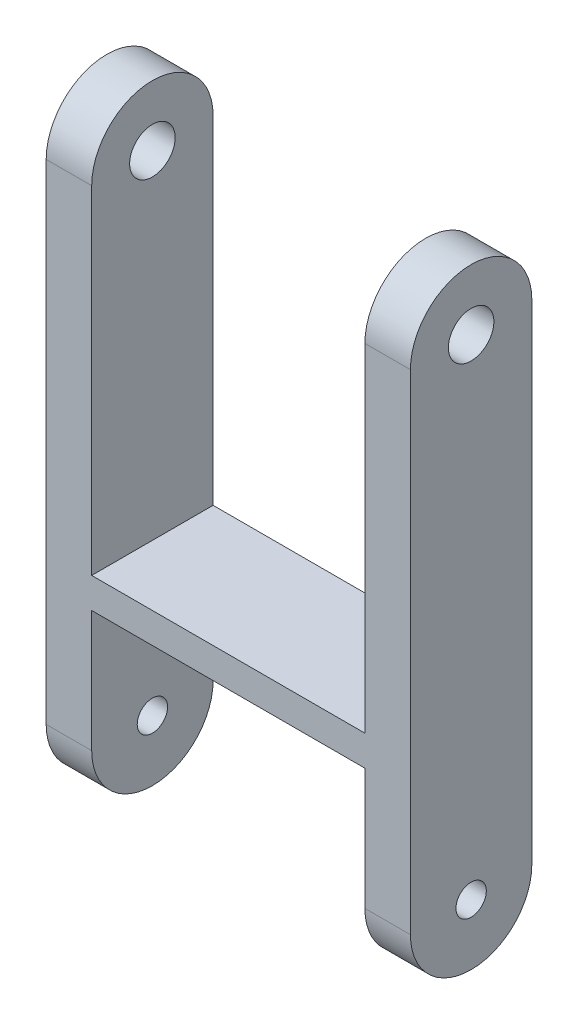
ISO-10303-21;
HEADER;
FILE_DESCRIPTION(('STEP AP214'),'2;1');
FILE_NAME('part.step','',(''),(''),'','','');
FILE_SCHEMA(('AUTOMOTIVE_DESIGN { 1 0 10303 214 1 1 1 1 }'));
ENDSEC;
DATA;
#1=APPLICATION_CONTEXT('core data for automotive mechanical design processes');
#2=APPLICATION_PROTOCOL_DEFINITION('international standard','automotive_design',2000,#1);
#3=PRODUCT_CONTEXT('',#1,'mechanical');
#4=PRODUCT('Part','Part','',(#3));
#5=PRODUCT_RELATED_PRODUCT_CATEGORY('part','',(#4));
#6=PRODUCT_DEFINITION_FORMATION('','',#4);
#7=PRODUCT_DEFINITION_CONTEXT('part definition',#1,'design');
#8=PRODUCT_DEFINITION('design','',#6,#7);
#9=PRODUCT_DEFINITION_SHAPE('','',#8);
#10=(LENGTH_UNIT() NAMED_UNIT(*) SI_UNIT(.MILLI.,.METRE.));
#11=(NAMED_UNIT(*) PLANE_ANGLE_UNIT() SI_UNIT($,.RADIAN.));
#12=(NAMED_UNIT(*) SI_UNIT($,.STERADIAN.) SOLID_ANGLE_UNIT());
#13=UNCERTAINTY_MEASURE_WITH_UNIT(LENGTH_MEASURE(1.E-05),#10,'distance_accuracy_value','');
#14=(GEOMETRIC_REPRESENTATION_CONTEXT(3) GLOBAL_UNCERTAINTY_ASSIGNED_CONTEXT((#13)) GLOBAL_UNIT_ASSIGNED_CONTEXT((#10,
#11,#12)) REPRESENTATION_CONTEXT('',''));
#15=CARTESIAN_POINT('',(0.,0.,0.));
#16=DIRECTION('',(0.,0.,1.));
#17=DIRECTION('',(1.,0.,0.));
#18=AXIS2_PLACEMENT_3D('',#15,#16,#17);
#19=CARTESIAN_POINT('',(76.2,-102.358208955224,0.));
#20=DIRECTION('',(-1.,0.,0.));
#21=DIRECTION('',(0.,0.,1.));
#22=AXIS2_PLACEMENT_3D('',#19,#20,#21);
#23=CYLINDRICAL_SURFACE('',#22,25.4);
#24=DIRECTION('',(-1.,0.,0.));
#25=VECTOR('',#24,1.);
#26=CARTESIAN_POINT('',(76.2,-102.358208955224,25.4));
#27=LINE('',#26,#25);
#28=CARTESIAN_POINT('',(76.2,-102.358208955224,25.4));
#29=VERTEX_POINT('',#28);
#30=CARTESIAN_POINT('',(57.15,-102.358208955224,25.4));
#31=VERTEX_POINT('',#30);
#32=EDGE_CURVE('E227',#29,#31,#27,.T.);
#33=ORIENTED_EDGE('',*,*,#32,.T.);
#34=CARTESIAN_POINT('',(57.15,-102.358208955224,0.));
#35=DIRECTION('',(1.,0.,0.));
#36=DIRECTION('',(0.,1.,0.));
#37=AXIS2_PLACEMENT_3D('',#34,#35,#36);
#38=CIRCLE('',#37,25.4);
#39=CARTESIAN_POINT('',(57.15,-102.358208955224,-25.4));
#40=VERTEX_POINT('',#39);
#41=EDGE_CURVE('E128',#31,#40,#38,.T.);
#42=ORIENTED_EDGE('',*,*,#41,.T.);
#43=DIRECTION('',(-1.,0.,0.));
#44=VECTOR('',#43,1.);
#45=CARTESIAN_POINT('',(76.2,-102.358208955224,-25.4));
#46=LINE('',#45,#44);
#47=CARTESIAN_POINT('',(76.2,-102.358208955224,-25.4));
#48=VERTEX_POINT('',#47);
#49=EDGE_CURVE('E223',#48,#40,#46,.T.);
#50=ORIENTED_EDGE('',*,*,#49,.F.);
#51=CARTESIAN_POINT('',(76.2,-102.358208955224,0.));
#52=DIRECTION('',(1.,0.,0.));
#53=DIRECTION('',(0.,0.,-1.));
#54=AXIS2_PLACEMENT_3D('',#51,#52,#53);
#55=CIRCLE('',#54,25.4);
#56=EDGE_CURVE('E214',#29,#48,#55,.T.);
#57=ORIENTED_EDGE('',*,*,#56,.F.);
#58=EDGE_LOOP('',(#33,#42,#50,#57));
#59=FACE_BOUND('',#58,.T.);
#60=ADVANCED_FACE('F31',(#59),#23,.T.);
#61=CARTESIAN_POINT('',(76.2,-102.358208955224,0.));
#62=DIRECTION('',(-1.,0.,0.));
#63=DIRECTION('',(0.,0.,1.));
#64=AXIS2_PLACEMENT_3D('',#61,#62,#63);
#65=CYLINDRICAL_SURFACE('',#64,6.35);
#66=CARTESIAN_POINT('',(57.15,-102.358208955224,0.));
#67=DIRECTION('',(1.,0.,0.));
#68=DIRECTION('',(0.,1.,0.));
#69=AXIS2_PLACEMENT_3D('',#66,#67,#68);
#70=CIRCLE('',#69,6.35);
#71=CARTESIAN_POINT('',(57.15,-102.358208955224,6.34999999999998));
#72=VERTEX_POINT('',#71);
#73=EDGE_CURVE('E35',#72,#72,#70,.T.);
#74=CARTESIAN_POINT('',(76.2,-102.358208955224,0.));
#75=DIRECTION('',(1.,0.,0.));
#76=DIRECTION('',(0.,0.,-1.));
#77=AXIS2_PLACEMENT_3D('',#74,#75,#76);
#78=CIRCLE('',#77,6.35);
#79=CARTESIAN_POINT('',(76.2,-102.358208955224,6.34999999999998));
#80=VERTEX_POINT('',#79);
#81=EDGE_CURVE('E188',#80,#80,#78,.T.);
#82=CARTESIAN_POINT('',(57.15,-102.358208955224,6.34999999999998));
#83=CARTESIAN_POINT('',(57.3484375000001,-102.358208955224,6.34999999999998));
#84=CARTESIAN_POINT('',(57.546875,-102.358208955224,6.34999999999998));
#85=CARTESIAN_POINT('',(57.94375,-102.358208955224,6.34999999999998));
#86=CARTESIAN_POINT('',(58.1421875,-102.358208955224,6.34999999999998));
#87=CARTESIAN_POINT('',(58.5390625,-102.358208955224,6.34999999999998));
#88=CARTESIAN_POINT('',(58.7375,-102.358208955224,6.34999999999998));
#89=CARTESIAN_POINT('',(59.134375,-102.358208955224,6.34999999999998));
#90=CARTESIAN_POINT('',(59.3328125,-102.358208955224,6.34999999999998));
#91=CARTESIAN_POINT('',(59.7296875,-102.358208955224,6.34999999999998));
#92=CARTESIAN_POINT('',(59.928125,-102.358208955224,6.34999999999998));
#93=CARTESIAN_POINT('',(60.325,-102.358208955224,6.34999999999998));
#94=CARTESIAN_POINT('',(60.5234375,-102.358208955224,6.34999999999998));
#95=CARTESIAN_POINT('',(60.9203125,-102.358208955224,6.34999999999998));
#96=CARTESIAN_POINT('',(61.11875,-102.358208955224,6.34999999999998));
#97=CARTESIAN_POINT('',(61.515625,-102.358208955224,6.34999999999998));
#98=CARTESIAN_POINT('',(61.7140625,-102.358208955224,6.34999999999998));
#99=CARTESIAN_POINT('',(62.1109375,-102.358208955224,6.34999999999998));
#100=CARTESIAN_POINT('',(62.309375,-102.358208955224,6.34999999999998));
#101=CARTESIAN_POINT('',(62.70625,-102.358208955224,6.34999999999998));
#102=CARTESIAN_POINT('',(62.9046875,-102.358208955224,6.34999999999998));
#103=CARTESIAN_POINT('',(63.3015625,-102.358208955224,6.34999999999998));
#104=CARTESIAN_POINT('',(63.5,-102.358208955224,6.34999999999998));
#105=CARTESIAN_POINT('',(63.896875,-102.358208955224,6.34999999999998));
#106=CARTESIAN_POINT('',(64.0953125,-102.358208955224,6.34999999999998));
#107=CARTESIAN_POINT('',(64.4921875,-102.358208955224,6.34999999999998));
#108=CARTESIAN_POINT('',(64.690625,-102.358208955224,6.34999999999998));
#109=CARTESIAN_POINT('',(65.0875,-102.358208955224,6.34999999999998));
#110=CARTESIAN_POINT('',(65.2859375,-102.358208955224,6.34999999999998));
#111=CARTESIAN_POINT('',(65.6828125,-102.358208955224,6.34999999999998));
#112=CARTESIAN_POINT('',(65.88125,-102.358208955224,6.34999999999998));
#113=CARTESIAN_POINT('',(66.278125,-102.358208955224,6.34999999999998));
#114=CARTESIAN_POINT('',(66.4765625,-102.358208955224,6.34999999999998));
#115=CARTESIAN_POINT('',(66.8734375,-102.358208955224,6.34999999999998));
#116=CARTESIAN_POINT('',(67.071875,-102.358208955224,6.34999999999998));
#117=CARTESIAN_POINT('',(67.46875,-102.358208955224,6.34999999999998));
#118=CARTESIAN_POINT('',(67.6671875,-102.358208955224,6.34999999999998));
#119=CARTESIAN_POINT('',(68.0640625,-102.358208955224,6.34999999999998));
#120=CARTESIAN_POINT('',(68.2625,-102.358208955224,6.34999999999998));
#121=CARTESIAN_POINT('',(68.659375,-102.358208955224,6.34999999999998));
#122=CARTESIAN_POINT('',(68.8578125,-102.358208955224,6.34999999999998));
#123=CARTESIAN_POINT('',(69.2546875,-102.358208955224,6.34999999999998));
#124=CARTESIAN_POINT('',(69.453125,-102.358208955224,6.34999999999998));
#125=CARTESIAN_POINT('',(69.85,-102.358208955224,6.34999999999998));
#126=CARTESIAN_POINT('',(70.0484375,-102.358208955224,6.34999999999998));
#127=CARTESIAN_POINT('',(70.4453125,-102.358208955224,6.34999999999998));
#128=CARTESIAN_POINT('',(70.64375,-102.358208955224,6.34999999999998));
#129=CARTESIAN_POINT('',(71.040625,-102.358208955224,6.34999999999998));
#130=CARTESIAN_POINT('',(71.2390625,-102.358208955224,6.34999999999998));
#131=CARTESIAN_POINT('',(71.6359375,-102.358208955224,6.34999999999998));
#132=CARTESIAN_POINT('',(71.834375,-102.358208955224,6.34999999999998));
#133=CARTESIAN_POINT('',(72.23125,-102.358208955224,6.34999999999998));
#134=CARTESIAN_POINT('',(72.4296875,-102.358208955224,6.34999999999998));
#135=CARTESIAN_POINT('',(72.8265625,-102.358208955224,6.34999999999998));
#136=CARTESIAN_POINT('',(73.025,-102.358208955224,6.34999999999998));
#137=CARTESIAN_POINT('',(73.421875,-102.358208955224,6.34999999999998));
#138=CARTESIAN_POINT('',(73.6203125,-102.358208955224,6.34999999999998));
#139=CARTESIAN_POINT('',(74.0171875,-102.358208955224,6.34999999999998));
#140=CARTESIAN_POINT('',(74.215625,-102.358208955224,6.34999999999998));
#141=CARTESIAN_POINT('',(74.6125,-102.358208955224,6.34999999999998));
#142=CARTESIAN_POINT('',(74.8109375,-102.358208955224,6.34999999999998));
#143=CARTESIAN_POINT('',(75.2078125,-102.358208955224,6.34999999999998));
#144=CARTESIAN_POINT('',(75.40625,-102.358208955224,6.34999999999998));
#145=CARTESIAN_POINT('',(75.803125,-102.358208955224,6.34999999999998));
#146=CARTESIAN_POINT('',(76.0015625,-102.358208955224,6.34999999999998));
#147=CARTESIAN_POINT('',(76.2,-102.358208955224,6.34999999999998));
#148=B_SPLINE_CURVE_WITH_KNOTS('',3,(#82,#83,#84,#85,#86,#87,#88,#89,#90,#91,#92,#93,#94,#95,
#96,#97,#98,#99,#100,#101,#102,#103,#104,#105,#106,#107,#108,#109,#110,#111,#112,#113,#114,#115,
#116,#117,#118,#119,#120,#121,#122,#123,#124,#125,#126,#127,#128,#129,#130,#131,#132,#133,#134,
#135,#136,#137,#138,#139,#140,#141,#142,#143,#144,#145,#146,#147),.UNSPECIFIED.,.F.,.F.,(4,2,2,
2,2,2,2,2,2,2,2,2,2,2,2,2,2,2,2,2,2,2,2,2,2,2,2,2,2,2,2,2,4),(0.,0.5953125,1.19062499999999,
1.78593749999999,2.38124999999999,2.97656249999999,3.57187499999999,4.16718749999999,
4.76249999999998,5.35781249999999,5.95312499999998,6.54843749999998,7.14374999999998,
7.73906249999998,8.33437499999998,8.92968749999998,9.52499999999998,10.1203125,10.715625,
11.3109375,11.90625,12.5015625,13.096875,13.6921875,14.2875,14.8828125,15.478125,16.0734375,
16.66875,17.2640625,17.859375,18.4546875,19.05),.UNSPECIFIED.);
#149=EDGE_CURVE('BSEAM243',#72,#80,#148,.T.);
#150=ORIENTED_EDGE('',*,*,#73,.F.);
#151=ORIENTED_EDGE('',*,*,#81,.T.);
#152=ORIENTED_EDGE('',*,*,#149,.T.);
#153=ORIENTED_EDGE('',*,*,#149,.F.);
#154=EDGE_LOOP('',(#150,#152,#151,#153));
#155=FACE_BOUND('',#154,.T.);
#156=ADVANCED_FACE('F243',(#155),#65,.F.);
#157=CARTESIAN_POINT('',(76.2,102.358208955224,0.));
#158=DIRECTION('',(-1.,0.,0.));
#159=DIRECTION('',(0.,0.,1.));
#160=AXIS2_PLACEMENT_3D('',#157,#158,#159);
#161=CYLINDRICAL_SURFACE('',#160,25.4);
#162=CARTESIAN_POINT('',(57.15,102.358208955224,0.));
#163=DIRECTION('',(1.,0.,0.));
#164=DIRECTION('',(0.,1.,0.));
#165=AXIS2_PLACEMENT_3D('',#162,#163,#164);
#166=CIRCLE('',#165,25.4);
#167=CARTESIAN_POINT('',(57.15,102.358208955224,-25.4));
#168=VERTEX_POINT('',#167);
#169=CARTESIAN_POINT('',(57.15,102.358208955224,25.4));
#170=VERTEX_POINT('',#169);
#171=EDGE_CURVE('E183',#168,#170,#166,.T.);
#172=ORIENTED_EDGE('',*,*,#171,.T.);
#173=DIRECTION('',(-1.,0.,0.));
#174=VECTOR('',#173,1.);
#175=CARTESIAN_POINT('',(76.2,102.358208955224,25.4));
#176=LINE('',#175,#174);
#177=CARTESIAN_POINT('',(76.2,102.358208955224,25.4));
#178=VERTEX_POINT('',#177);
#179=EDGE_CURVE('E11',#178,#170,#176,.T.);
#180=ORIENTED_EDGE('',*,*,#179,.F.);
#181=CARTESIAN_POINT('',(76.2,102.358208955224,0.));
#182=DIRECTION('',(1.,0.,0.));
#183=DIRECTION('',(0.,0.,1.));
#184=AXIS2_PLACEMENT_3D('',#181,#182,#183);
#185=CIRCLE('',#184,25.4);
#186=CARTESIAN_POINT('',(76.2,102.358208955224,-25.4));
#187=VERTEX_POINT('',#186);
#188=EDGE_CURVE('E209',#187,#178,#185,.T.);
#189=ORIENTED_EDGE('',*,*,#188,.F.);
#190=DIRECTION('',(-1.,0.,0.));
#191=VECTOR('',#190,1.);
#192=CARTESIAN_POINT('',(76.2,102.358208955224,-25.4));
#193=LINE('',#192,#191);
#194=EDGE_CURVE('E219',#187,#168,#193,.T.);
#195=ORIENTED_EDGE('',*,*,#194,.T.);
#196=EDGE_LOOP('',(#172,#180,#189,#195));
#197=FACE_BOUND('',#196,.T.);
#198=ADVANCED_FACE('F256',(#197),#161,.T.);
#199=CARTESIAN_POINT('',(76.2,102.358208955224,0.));
#200=DIRECTION('',(-1.,0.,0.));
#201=DIRECTION('',(0.,0.,1.));
#202=AXIS2_PLACEMENT_3D('',#199,#200,#201);
#203=CYLINDRICAL_SURFACE('',#202,9.525);
#204=CARTESIAN_POINT('',(57.15,102.358208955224,0.));
#205=DIRECTION('',(1.,0.,0.));
#206=DIRECTION('',(0.,1.,0.));
#207=AXIS2_PLACEMENT_3D('',#204,#205,#206);
#208=CIRCLE('',#207,9.525);
#209=CARTESIAN_POINT('',(57.15,102.358208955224,9.52499999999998));
#210=VERTEX_POINT('',#209);
#211=EDGE_CURVE('E182',#210,#210,#208,.T.);
#212=CARTESIAN_POINT('',(76.2,102.358208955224,0.));
#213=DIRECTION('',(1.,0.,0.));
#214=DIRECTION('',(0.,0.,-1.));
#215=AXIS2_PLACEMENT_3D('',#212,#213,#214);
#216=CIRCLE('',#215,9.525);
#217=CARTESIAN_POINT('',(76.2,102.358208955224,9.52499999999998));
#218=VERTEX_POINT('',#217);
#219=EDGE_CURVE('E194',#218,#218,#216,.T.);
#220=CARTESIAN_POINT('',(57.15,102.358208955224,9.52499999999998));
#221=CARTESIAN_POINT('',(57.3484375,102.358208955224,9.52499999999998));
#222=CARTESIAN_POINT('',(57.546875,102.358208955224,9.52499999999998));
#223=CARTESIAN_POINT('',(57.94375,102.358208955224,9.52499999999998));
#224=CARTESIAN_POINT('',(58.1421875,102.358208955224,9.52499999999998));
#225=CARTESIAN_POINT('',(58.5390625,102.358208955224,9.52499999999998));
#226=CARTESIAN_POINT('',(58.7375,102.358208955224,9.52499999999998));
#227=CARTESIAN_POINT('',(59.134375,102.358208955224,9.52499999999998));
#228=CARTESIAN_POINT('',(59.3328125,102.358208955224,9.52499999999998));
#229=CARTESIAN_POINT('',(59.7296875,102.358208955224,9.52499999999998));
#230=CARTESIAN_POINT('',(59.928125,102.358208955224,9.52499999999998));
#231=CARTESIAN_POINT('',(60.325,102.358208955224,9.52499999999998));
#232=CARTESIAN_POINT('',(60.5234375,102.358208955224,9.52499999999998));
#233=CARTESIAN_POINT('',(60.9203125,102.358208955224,9.52499999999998));
#234=CARTESIAN_POINT('',(61.11875,102.358208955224,9.52499999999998));
#235=CARTESIAN_POINT('',(61.515625,102.358208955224,9.52499999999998));
#236=CARTESIAN_POINT('',(61.7140625,102.358208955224,9.52499999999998));
#237=CARTESIAN_POINT('',(62.1109375,102.358208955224,9.52499999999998));
#238=CARTESIAN_POINT('',(62.309375,102.358208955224,9.52499999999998));
#239=CARTESIAN_POINT('',(62.70625,102.358208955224,9.52499999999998));
#240=CARTESIAN_POINT('',(62.9046875,102.358208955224,9.52499999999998));
#241=CARTESIAN_POINT('',(63.3015625,102.358208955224,9.52499999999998));
#242=CARTESIAN_POINT('',(63.5,102.358208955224,9.52499999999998));
#243=CARTESIAN_POINT('',(63.896875,102.358208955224,9.52499999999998));
#244=CARTESIAN_POINT('',(64.0953125,102.358208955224,9.52499999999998));
#245=CARTESIAN_POINT('',(64.4921875,102.358208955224,9.52499999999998));
#246=CARTESIAN_POINT('',(64.690625,102.358208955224,9.52499999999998));
#247=CARTESIAN_POINT('',(65.0875,102.358208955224,9.52499999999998));
#248=CARTESIAN_POINT('',(65.2859375,102.358208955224,9.52499999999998));
#249=CARTESIAN_POINT('',(65.6828125,102.358208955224,9.52499999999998));
#250=CARTESIAN_POINT('',(65.88125,102.358208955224,9.52499999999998));
#251=CARTESIAN_POINT('',(66.278125,102.358208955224,9.52499999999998));
#252=CARTESIAN_POINT('',(66.4765625,102.358208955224,9.52499999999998));
#253=CARTESIAN_POINT('',(66.8734375,102.358208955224,9.52499999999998));
#254=CARTESIAN_POINT('',(67.071875,102.358208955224,9.52499999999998));
#255=CARTESIAN_POINT('',(67.46875,102.358208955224,9.52499999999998));
#256=CARTESIAN_POINT('',(67.6671875,102.358208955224,9.52499999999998));
#257=CARTESIAN_POINT('',(68.0640625,102.358208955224,9.52499999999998));
#258=CARTESIAN_POINT('',(68.2625,102.358208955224,9.52499999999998));
#259=CARTESIAN_POINT('',(68.659375,102.358208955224,9.52499999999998));
#260=CARTESIAN_POINT('',(68.8578125,102.358208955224,9.52499999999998));
#261=CARTESIAN_POINT('',(69.2546875,102.358208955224,9.52499999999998));
#262=CARTESIAN_POINT('',(69.453125,102.358208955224,9.52499999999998));
#263=CARTESIAN_POINT('',(69.85,102.358208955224,9.52499999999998));
#264=CARTESIAN_POINT('',(70.0484375,102.358208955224,9.52499999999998));
#265=CARTESIAN_POINT('',(70.4453125,102.358208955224,9.52499999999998));
#266=CARTESIAN_POINT('',(70.64375,102.358208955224,9.52499999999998));
#267=CARTESIAN_POINT('',(71.040625,102.358208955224,9.52499999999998));
#268=CARTESIAN_POINT('',(71.2390625,102.358208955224,9.52499999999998));
#269=CARTESIAN_POINT('',(71.6359375,102.358208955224,9.52499999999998));
#270=CARTESIAN_POINT('',(71.834375,102.358208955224,9.52499999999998));
#271=CARTESIAN_POINT('',(72.23125,102.358208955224,9.52499999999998));
#272=CARTESIAN_POINT('',(72.4296875,102.358208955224,9.52499999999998));
#273=CARTESIAN_POINT('',(72.8265625,102.358208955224,9.52499999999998));
#274=CARTESIAN_POINT('',(73.025,102.358208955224,9.52499999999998));
#275=CARTESIAN_POINT('',(73.421875,102.358208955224,9.52499999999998));
#276=CARTESIAN_POINT('',(73.6203125,102.358208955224,9.52499999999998));
#277=CARTESIAN_POINT('',(74.0171875,102.358208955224,9.52499999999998));
#278=CARTESIAN_POINT('',(74.215625,102.358208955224,9.52499999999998));
#279=CARTESIAN_POINT('',(74.6125,102.358208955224,9.52499999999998));
#280=CARTESIAN_POINT('',(74.8109375,102.358208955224,9.52499999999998));
#281=CARTESIAN_POINT('',(75.2078125,102.358208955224,9.52499999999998));
#282=CARTESIAN_POINT('',(75.40625,102.358208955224,9.52499999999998));
#283=CARTESIAN_POINT('',(75.803125,102.358208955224,9.52499999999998));
#284=CARTESIAN_POINT('',(76.0015625,102.358208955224,9.52499999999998));
#285=CARTESIAN_POINT('',(76.2,102.358208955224,9.52499999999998));
#286=B_SPLINE_CURVE_WITH_KNOTS('',3,(#220,#221,#222,#223,#224,#225,#226,#227,#228,#229,#230,
#231,#232,#233,#234,#235,#236,#237,#238,#239,#240,#241,#242,#243,#244,#245,#246,#247,#248,#249,
#250,#251,#252,#253,#254,#255,#256,#257,#258,#259,#260,#261,#262,#263,#264,#265,#266,#267,#268,
#269,#270,#271,#272,#273,#274,#275,#276,#277,#278,#279,#280,#281,#282,#283,#284,#285),
.UNSPECIFIED.,.F.,.F.,(4,2,2,2,2,2,2,2,2,2,2,2,2,2,2,2,2,2,2,2,2,2,2,2,2,2,2,2,2,2,2,2,4),(0.,
0.5953125,1.190625,1.7859375,2.38125,2.97656249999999,3.571875,4.1671875,4.7625,
5.35781249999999,5.95312499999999,6.54843749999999,7.14374999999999,7.73906249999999,
8.33437499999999,8.92968749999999,9.52499999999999,10.1203125,10.715625,11.3109375,11.90625,
12.5015625,13.096875,13.6921875,14.2875,14.8828125,15.478125,16.0734375,16.66875,17.2640625,
17.859375,18.4546875,19.05),.UNSPECIFIED.);
#287=EDGE_CURVE('BSEAM257',#210,#218,#286,.T.);
#288=ORIENTED_EDGE('',*,*,#211,.F.);
#289=ORIENTED_EDGE('',*,*,#219,.T.);
#290=ORIENTED_EDGE('',*,*,#287,.T.);
#291=ORIENTED_EDGE('',*,*,#287,.F.);
#292=EDGE_LOOP('',(#288,#290,#289,#291));
#293=FACE_BOUND('',#292,.T.);
#294=ADVANCED_FACE('F257',(#293),#203,.F.);
#295=CARTESIAN_POINT('',(76.2,102.358208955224,0.));
#296=DIRECTION('',(-1.,0.,0.));
#297=DIRECTION('',(0.,0.,1.));
#298=AXIS2_PLACEMENT_3D('',#295,#296,#297);
#299=PLANE('',#298);
#300=ORIENTED_EDGE('',*,*,#219,.F.);
#301=EDGE_LOOP('',(#300));
#302=FACE_BOUND('',#301,.T.);
#303=ORIENTED_EDGE('',*,*,#188,.T.);
#304=DIRECTION('',(0.,-1.,0.));
#305=VECTOR('',#304,1.);
#306=CARTESIAN_POINT('',(76.2,102.358208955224,25.4));
#307=LINE('',#306,#305);
#308=EDGE_CURVE('E212',#178,#29,#307,.T.);
#309=ORIENTED_EDGE('',*,*,#308,.T.);
#310=ORIENTED_EDGE('',*,*,#56,.T.);
#311=DIRECTION('',(0.,1.,0.));
#312=VECTOR('',#311,1.);
#313=CARTESIAN_POINT('',(76.2,102.358208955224,-25.4));
#314=LINE('',#313,#312);
#315=EDGE_CURVE('E216',#48,#187,#314,.T.);
#316=ORIENTED_EDGE('',*,*,#315,.T.);
#317=EDGE_LOOP('',(#303,#309,#310,#316));
#318=FACE_BOUND('',#317,.T.);
#319=ORIENTED_EDGE('',*,*,#81,.F.);
#320=EDGE_LOOP('',(#319));
#321=FACE_BOUND('',#320,.T.);
#322=ADVANCED_FACE('F248',(#302,#318,#321),#299,.F.);
#323=CARTESIAN_POINT('',(-76.2,102.358208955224,0.));
#324=DIRECTION('',(-1.,0.,0.));
#325=DIRECTION('',(0.,0.,1.));
#326=AXIS2_PLACEMENT_3D('',#323,#324,#325);
#327=PLANE('',#326);
#328=CARTESIAN_POINT('',(-76.2,102.358208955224,0.));
#329=DIRECTION('',(1.,0.,0.));
#330=DIRECTION('',(0.,0.,-1.));
#331=AXIS2_PLACEMENT_3D('',#328,#329,#330);
#332=CIRCLE('',#331,9.525);
#333=CARTESIAN_POINT('',(-76.2,102.358208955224,9.52499999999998));
#334=VERTEX_POINT('',#333);
#335=EDGE_CURVE('E191',#334,#334,#332,.T.);
#336=ORIENTED_EDGE('',*,*,#335,.T.);
#337=EDGE_LOOP('',(#336));
#338=FACE_BOUND('',#337,.T.);
#339=CARTESIAN_POINT('',(-76.2,102.358208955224,0.));
#340=DIRECTION('',(1.,0.,0.));
#341=DIRECTION('',(0.,0.,1.));
#342=AXIS2_PLACEMENT_3D('',#339,#340,#341);
#343=CIRCLE('',#342,25.4);
#344=CARTESIAN_POINT('',(-76.2,102.358208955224,-25.4));
#345=VERTEX_POINT('',#344);
#346=CARTESIAN_POINT('',(-76.2,102.358208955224,25.4));
#347=VERTEX_POINT('',#346);
#348=EDGE_CURVE('E197',#345,#347,#343,.T.);
#349=ORIENTED_EDGE('',*,*,#348,.F.);
#350=DIRECTION('',(0.,1.,0.));
#351=VECTOR('',#350,1.);
#352=CARTESIAN_POINT('',(-76.2,102.358208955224,-25.4));
#353=LINE('',#352,#351);
#354=CARTESIAN_POINT('',(-76.2,-102.358208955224,-25.4));
#355=VERTEX_POINT('',#354);
#356=EDGE_CURVE('E206',#355,#345,#353,.T.);
#357=ORIENTED_EDGE('',*,*,#356,.F.);
#358=CARTESIAN_POINT('',(-76.2,-102.358208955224,0.));
#359=DIRECTION('',(1.,0.,0.));
#360=DIRECTION('',(0.,0.,-1.));
#361=AXIS2_PLACEMENT_3D('',#358,#359,#360);
#362=CIRCLE('',#361,25.4);
#363=CARTESIAN_POINT('',(-76.2,-102.358208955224,25.4));
#364=VERTEX_POINT('',#363);
#365=EDGE_CURVE('E203',#364,#355,#362,.T.);
#366=ORIENTED_EDGE('',*,*,#365,.F.);
#367=DIRECTION('',(0.,-1.,0.));
#368=VECTOR('',#367,1.);
#369=CARTESIAN_POINT('',(-76.2,102.358208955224,25.4));
#370=LINE('',#369,#368);
#371=EDGE_CURVE('E200',#347,#364,#370,.T.);
#372=ORIENTED_EDGE('',*,*,#371,.F.);
#373=EDGE_LOOP('',(#349,#357,#366,#372));
#374=FACE_BOUND('',#373,.T.);
#375=CARTESIAN_POINT('',(-76.2,-102.358208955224,0.));
#376=DIRECTION('',(1.,0.,0.));
#377=DIRECTION('',(0.,0.,-1.));
#378=AXIS2_PLACEMENT_3D('',#375,#376,#377);
#379=CIRCLE('',#378,6.35);
#380=CARTESIAN_POINT('',(-76.2,-102.358208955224,6.34999999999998));
#381=VERTEX_POINT('',#380);
#382=EDGE_CURVE('E185',#381,#381,#379,.T.);
#383=ORIENTED_EDGE('',*,*,#382,.T.);
#384=EDGE_LOOP('',(#383));
#385=FACE_BOUND('',#384,.T.);
#386=ADVANCED_FACE('F246',(#338,#374,#385),#327,.T.);
#387=CARTESIAN_POINT('',(-57.15,102.358208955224,25.4));
#388=VERTEX_POINT('',#387);
#389=EDGE_CURVE('E40',#388,#347,#176,.T.);
#390=ORIENTED_EDGE('',*,*,#389,.F.);
#391=CARTESIAN_POINT('',(-57.15,102.358208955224,0.));
#392=DIRECTION('',(-1.,0.,0.));
#393=DIRECTION('',(0.,-1.,0.));
#394=AXIS2_PLACEMENT_3D('',#391,#392,#393);
#395=CIRCLE('',#394,25.4);
#396=CARTESIAN_POINT('',(-57.15,102.358208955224,-25.4));
#397=VERTEX_POINT('',#396);
#398=EDGE_CURVE('E180',#388,#397,#395,.T.);
#399=ORIENTED_EDGE('',*,*,#398,.T.);
#400=EDGE_CURVE('E218',#397,#345,#193,.T.);
#401=ORIENTED_EDGE('',*,*,#400,.T.);
#402=ORIENTED_EDGE('',*,*,#348,.T.);
#403=EDGE_LOOP('',(#390,#399,#401,#402));
#404=FACE_BOUND('',#403,.T.);
#405=ADVANCED_FACE('F33',(#404),#161,.T.);
#406=CARTESIAN_POINT('',(76.2,102.358208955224,25.4));
#407=DIRECTION('',(0.,0.,-1.));
#408=DIRECTION('',(0.,1.,0.));
#409=AXIS2_PLACEMENT_3D('',#406,#407,#408);
#410=PLANE('',#409);
#411=DIRECTION('',(-1.,0.,0.));
#412=VECTOR('',#411,1.);
#413=CARTESIAN_POINT('',(57.15,-51.5582089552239,25.4));
#414=LINE('',#413,#412);
#415=CARTESIAN_POINT('',(57.15,-51.5582089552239,25.4));
#416=VERTEX_POINT('',#415);
#417=CARTESIAN_POINT('',(-57.15,-51.5582089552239,25.4));
#418=VERTEX_POINT('',#417);
#419=EDGE_CURVE('E133',#416,#418,#414,.T.);
#420=ORIENTED_EDGE('',*,*,#419,.F.);
#421=DIRECTION('',(0.,1.,0.));
#422=VECTOR('',#421,1.);
#423=CARTESIAN_POINT('',(57.15,-127.758208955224,25.4));
#424=LINE('',#423,#422);
#425=EDGE_CURVE('E122',#31,#416,#424,.T.);
#426=ORIENTED_EDGE('',*,*,#425,.F.);
#427=ORIENTED_EDGE('',*,*,#32,.F.);
#428=ORIENTED_EDGE('',*,*,#308,.F.);
#429=ORIENTED_EDGE('',*,*,#179,.T.);
#430=DIRECTION('',(0.,1.,0.));
#431=VECTOR('',#430,1.);
#432=CARTESIAN_POINT('',(57.15,127.758208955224,25.4));
#433=LINE('',#432,#431);
#434=CARTESIAN_POINT('',(57.15,-38.8582089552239,25.4));
#435=VERTEX_POINT('',#434);
#436=EDGE_CURVE('E160',#435,#170,#433,.T.);
#437=ORIENTED_EDGE('',*,*,#436,.F.);
#438=DIRECTION('',(1.,0.,0.));
#439=VECTOR('',#438,1.);
#440=CARTESIAN_POINT('',(57.15,-38.8582089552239,25.4));
#441=LINE('',#440,#439);
#442=CARTESIAN_POINT('',(-57.15,-38.8582089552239,25.4));
#443=VERTEX_POINT('',#442);
#444=EDGE_CURVE('E165',#443,#435,#441,.T.);
#445=ORIENTED_EDGE('',*,*,#444,.F.);
#446=DIRECTION('',(0.,-1.,0.));
#447=VECTOR('',#446,1.);
#448=CARTESIAN_POINT('',(-57.15,127.758208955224,25.4));
#449=LINE('',#448,#447);
#450=EDGE_CURVE('E163',#388,#443,#449,.T.);
#451=ORIENTED_EDGE('',*,*,#450,.F.);
#452=ORIENTED_EDGE('',*,*,#389,.T.);
#453=ORIENTED_EDGE('',*,*,#371,.T.);
#454=CARTESIAN_POINT('',(-57.15,-102.358208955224,25.4));
#455=VERTEX_POINT('',#454);
#456=EDGE_CURVE('E226',#455,#364,#27,.T.);
#457=ORIENTED_EDGE('',*,*,#456,.F.);
#458=DIRECTION('',(0.,-1.,0.));
#459=VECTOR('',#458,1.);
#460=CARTESIAN_POINT('',(-57.15,-127.758208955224,25.4));
#461=LINE('',#460,#459);
#462=EDGE_CURVE('E147',#418,#455,#461,.T.);
#463=ORIENTED_EDGE('',*,*,#462,.F.);
#464=EDGE_LOOP('',(#420,#426,#427,#428,#429,#437,#445,#451,#452,#453,#457,#463));
#465=FACE_BOUND('',#464,.T.);
#466=ADVANCED_FACE('F144',(#465),#410,.F.);
#467=CARTESIAN_POINT('',(-57.15,-102.358208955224,0.));
#468=DIRECTION('',(-1.,0.,0.));
#469=DIRECTION('',(0.,-1.,0.));
#470=AXIS2_PLACEMENT_3D('',#467,#468,#469);
#471=CIRCLE('',#470,25.4);
#472=CARTESIAN_POINT('',(-57.15,-102.358208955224,-25.4));
#473=VERTEX_POINT('',#472);
#474=EDGE_CURVE('E157',#473,#455,#471,.T.);
#475=ORIENTED_EDGE('',*,*,#474,.T.);
#476=ORIENTED_EDGE('',*,*,#456,.T.);
#477=ORIENTED_EDGE('',*,*,#365,.T.);
#478=EDGE_CURVE('E222',#473,#355,#46,.T.);
#479=ORIENTED_EDGE('',*,*,#478,.F.);
#480=EDGE_LOOP('',(#475,#476,#477,#479));
#481=FACE_BOUND('',#480,.T.);
#482=ADVANCED_FACE('F265',(#481),#23,.T.);
#483=CARTESIAN_POINT('',(76.2,102.358208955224,-25.4));
#484=DIRECTION('',(0.,0.,1.));
#485=DIRECTION('',(0.,-1.,0.));
#486=AXIS2_PLACEMENT_3D('',#483,#484,#485);
#487=PLANE('',#486);
#488=ORIENTED_EDGE('',*,*,#49,.T.);
#489=DIRECTION('',(0.,1.,0.));
#490=VECTOR('',#489,1.);
#491=CARTESIAN_POINT('',(57.15,-127.758208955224,-25.4));
#492=LINE('',#491,#490);
#493=CARTESIAN_POINT('',(57.15,-51.5582089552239,-25.4));
#494=VERTEX_POINT('',#493);
#495=EDGE_CURVE('E149',#40,#494,#492,.T.);
#496=ORIENTED_EDGE('',*,*,#495,.T.);
#497=DIRECTION('',(-1.,0.,0.));
#498=VECTOR('',#497,1.);
#499=CARTESIAN_POINT('',(57.15,-51.5582089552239,-25.4));
#500=LINE('',#499,#498);
#501=CARTESIAN_POINT('',(-57.15,-51.5582089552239,-25.4));
#502=VERTEX_POINT('',#501);
#503=EDGE_CURVE('E140',#494,#502,#500,.T.);
#504=ORIENTED_EDGE('',*,*,#503,.T.);
#505=DIRECTION('',(0.,-1.,0.));
#506=VECTOR('',#505,1.);
#507=CARTESIAN_POINT('',(-57.15,-127.758208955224,-25.4));
#508=LINE('',#507,#506);
#509=EDGE_CURVE('E48',#502,#473,#508,.T.);
#510=ORIENTED_EDGE('',*,*,#509,.T.);
#511=ORIENTED_EDGE('',*,*,#478,.T.);
#512=ORIENTED_EDGE('',*,*,#356,.T.);
#513=ORIENTED_EDGE('',*,*,#400,.F.);
#514=DIRECTION('',(0.,-1.,0.));
#515=VECTOR('',#514,1.);
#516=CARTESIAN_POINT('',(-57.15,127.758208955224,-25.4));
#517=LINE('',#516,#515);
#518=CARTESIAN_POINT('',(-57.15,-38.8582089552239,-25.4));
#519=VERTEX_POINT('',#518);
#520=EDGE_CURVE('E171',#397,#519,#517,.T.);
#521=ORIENTED_EDGE('',*,*,#520,.T.);
#522=DIRECTION('',(1.,0.,0.));
#523=VECTOR('',#522,1.);
#524=CARTESIAN_POINT('',(57.15,-38.8582089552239,-25.4));
#525=LINE('',#524,#523);
#526=CARTESIAN_POINT('',(57.15,-38.8582089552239,-25.4));
#527=VERTEX_POINT('',#526);
#528=EDGE_CURVE('E56',#519,#527,#525,.T.);
#529=ORIENTED_EDGE('',*,*,#528,.T.);
#530=DIRECTION('',(0.,1.,0.));
#531=VECTOR('',#530,1.);
#532=CARTESIAN_POINT('',(57.15,127.758208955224,-25.4));
#533=LINE('',#532,#531);
#534=EDGE_CURVE('E168',#527,#168,#533,.T.);
#535=ORIENTED_EDGE('',*,*,#534,.T.);
#536=ORIENTED_EDGE('',*,*,#194,.F.);
#537=ORIENTED_EDGE('',*,*,#315,.F.);
#538=EDGE_LOOP('',(#488,#496,#504,#510,#511,#512,#513,#521,#529,#535,#536,#537));
#539=FACE_BOUND('',#538,.T.);
#540=ADVANCED_FACE('F272',(#539),#487,.F.);
#541=CARTESIAN_POINT('',(-57.15,102.358208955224,0.));
#542=DIRECTION('',(-1.,0.,0.));
#543=DIRECTION('',(0.,-1.,0.));
#544=AXIS2_PLACEMENT_3D('',#541,#542,#543);
#545=CIRCLE('',#544,9.525);
#546=CARTESIAN_POINT('',(-57.15,102.358208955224,9.52499999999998));
#547=VERTEX_POINT('',#546);
#548=EDGE_CURVE('E178',#547,#547,#545,.T.);
#549=CARTESIAN_POINT('',(-57.15,102.358208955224,9.52499999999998));
#550=CARTESIAN_POINT('',(-57.3484375,102.358208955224,9.52499999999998));
#551=CARTESIAN_POINT('',(-57.546875,102.358208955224,9.52499999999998));
#552=CARTESIAN_POINT('',(-57.94375,102.358208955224,9.52499999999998));
#553=CARTESIAN_POINT('',(-58.1421875,102.358208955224,9.52499999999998));
#554=CARTESIAN_POINT('',(-58.5390625,102.358208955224,9.52499999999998));
#555=CARTESIAN_POINT('',(-58.7375,102.358208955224,9.52499999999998));
#556=CARTESIAN_POINT('',(-59.134375,102.358208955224,9.52499999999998));
#557=CARTESIAN_POINT('',(-59.3328125,102.358208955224,9.52499999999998));
#558=CARTESIAN_POINT('',(-59.7296875,102.358208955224,9.52499999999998));
#559=CARTESIAN_POINT('',(-59.928125,102.358208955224,9.52499999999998));
#560=CARTESIAN_POINT('',(-60.325,102.358208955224,9.52499999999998));
#561=CARTESIAN_POINT('',(-60.5234375,102.358208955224,9.52499999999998));
#562=CARTESIAN_POINT('',(-60.9203125,102.358208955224,9.52499999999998));
#563=CARTESIAN_POINT('',(-61.11875,102.358208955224,9.52499999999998));
#564=CARTESIAN_POINT('',(-61.515625,102.358208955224,9.52499999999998));
#565=CARTESIAN_POINT('',(-61.7140625,102.358208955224,9.52499999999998));
#566=CARTESIAN_POINT('',(-62.1109375,102.358208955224,9.52499999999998));
#567=CARTESIAN_POINT('',(-62.309375,102.358208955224,9.52499999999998));
#568=CARTESIAN_POINT('',(-62.70625,102.358208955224,9.52499999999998));
#569=CARTESIAN_POINT('',(-62.9046875,102.358208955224,9.52499999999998));
#570=CARTESIAN_POINT('',(-63.3015625,102.358208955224,9.52499999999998));
#571=CARTESIAN_POINT('',(-63.5,102.358208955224,9.52499999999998));
#572=CARTESIAN_POINT('',(-63.896875,102.358208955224,9.52499999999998));
#573=CARTESIAN_POINT('',(-64.0953125,102.358208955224,9.52499999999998));
#574=CARTESIAN_POINT('',(-64.4921875,102.358208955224,9.52499999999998));
#575=CARTESIAN_POINT('',(-64.690625,102.358208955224,9.52499999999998));
#576=CARTESIAN_POINT('',(-65.0875,102.358208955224,9.52499999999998));
#577=CARTESIAN_POINT('',(-65.2859375,102.358208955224,9.52499999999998));
#578=CARTESIAN_POINT('',(-65.6828125,102.358208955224,9.52499999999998));
#579=CARTESIAN_POINT('',(-65.88125,102.358208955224,9.52499999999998));
#580=CARTESIAN_POINT('',(-66.278125,102.358208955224,9.52499999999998));
#581=CARTESIAN_POINT('',(-66.4765625,102.358208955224,9.52499999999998));
#582=CARTESIAN_POINT('',(-66.8734375,102.358208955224,9.52499999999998));
#583=CARTESIAN_POINT('',(-67.071875,102.358208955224,9.52499999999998));
#584=CARTESIAN_POINT('',(-67.46875,102.358208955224,9.52499999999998));
#585=CARTESIAN_POINT('',(-67.6671875,102.358208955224,9.52499999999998));
#586=CARTESIAN_POINT('',(-68.0640625,102.358208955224,9.52499999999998));
#587=CARTESIAN_POINT('',(-68.2625,102.358208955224,9.52499999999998));
#588=CARTESIAN_POINT('',(-68.659375,102.358208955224,9.52499999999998));
#589=CARTESIAN_POINT('',(-68.8578125,102.358208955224,9.52499999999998));
#590=CARTESIAN_POINT('',(-69.2546875,102.358208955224,9.52499999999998));
#591=CARTESIAN_POINT('',(-69.453125,102.358208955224,9.52499999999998));
#592=CARTESIAN_POINT('',(-69.85,102.358208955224,9.52499999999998));
#593=CARTESIAN_POINT('',(-70.0484375,102.358208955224,9.52499999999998));
#594=CARTESIAN_POINT('',(-70.4453125,102.358208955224,9.52499999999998));
#595=CARTESIAN_POINT('',(-70.64375,102.358208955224,9.52499999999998));
#596=CARTESIAN_POINT('',(-71.040625,102.358208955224,9.52499999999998));
#597=CARTESIAN_POINT('',(-71.2390625,102.358208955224,9.52499999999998));
#598=CARTESIAN_POINT('',(-71.6359375,102.358208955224,9.52499999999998));
#599=CARTESIAN_POINT('',(-71.834375,102.358208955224,9.52499999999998));
#600=CARTESIAN_POINT('',(-72.23125,102.358208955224,9.52499999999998));
#601=CARTESIAN_POINT('',(-72.4296875,102.358208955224,9.52499999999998));
#602=CARTESIAN_POINT('',(-72.8265625,102.358208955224,9.52499999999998));
#603=CARTESIAN_POINT('',(-73.025,102.358208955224,9.52499999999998));
#604=CARTESIAN_POINT('',(-73.421875,102.358208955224,9.52499999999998));
#605=CARTESIAN_POINT('',(-73.6203125,102.358208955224,9.52499999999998));
#606=CARTESIAN_POINT('',(-74.0171875,102.358208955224,9.52499999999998));
#607=CARTESIAN_POINT('',(-74.215625,102.358208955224,9.52499999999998));
#608=CARTESIAN_POINT('',(-74.6125,102.358208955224,9.52499999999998));
#609=CARTESIAN_POINT('',(-74.8109375,102.358208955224,9.52499999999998));
#610=CARTESIAN_POINT('',(-75.2078125,102.358208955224,9.52499999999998));
#611=CARTESIAN_POINT('',(-75.40625,102.358208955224,9.52499999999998));
#612=CARTESIAN_POINT('',(-75.803125,102.358208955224,9.52499999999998));
#613=CARTESIAN_POINT('',(-76.0015625,102.358208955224,9.52499999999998));
#614=CARTESIAN_POINT('',(-76.2,102.358208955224,9.52499999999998));
#615=B_SPLINE_CURVE_WITH_KNOTS('',3,(#549,#550,#551,#552,#553,#554,#555,#556,#557,#558,#559,
#560,#561,#562,#563,#564,#565,#566,#567,#568,#569,#570,#571,#572,#573,#574,#575,#576,#577,#578,
#579,#580,#581,#582,#583,#584,#585,#586,#587,#588,#589,#590,#591,#592,#593,#594,#595,#596,#597,
#598,#599,#600,#601,#602,#603,#604,#605,#606,#607,#608,#609,#610,#611,#612,#613,#614),
.UNSPECIFIED.,.F.,.F.,(4,2,2,2,2,2,2,2,2,2,2,2,2,2,2,2,2,2,2,2,2,2,2,2,2,2,2,2,2,2,2,2,4),(0.,
0.5953125,1.190625,1.7859375,2.38125,2.9765625,3.571875,4.1671875,4.7625,5.3578125,5.953125,
6.5484375,7.14375,7.7390625,8.334375,8.92968750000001,9.52500000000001,10.1203125,10.715625,
11.3109375,11.90625,12.5015625,13.096875,13.6921875,14.2875,14.8828125,15.478125,16.0734375,
16.66875,17.2640625,17.859375,18.4546875,19.05),.UNSPECIFIED.);
#616=EDGE_CURVE('BSEAM241',#547,#334,#615,.T.);
#617=ORIENTED_EDGE('',*,*,#548,.F.);
#618=ORIENTED_EDGE('',*,*,#335,.F.);
#619=ORIENTED_EDGE('',*,*,#616,.T.);
#620=ORIENTED_EDGE('',*,*,#616,.F.);
#621=EDGE_LOOP('',(#617,#619,#618,#620));
#622=FACE_BOUND('',#621,.T.);
#623=ADVANCED_FACE('F241',(#622),#203,.F.);
#624=CARTESIAN_POINT('',(-57.15,-102.358208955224,0.));
#625=DIRECTION('',(-1.,0.,0.));
#626=DIRECTION('',(0.,-1.,0.));
#627=AXIS2_PLACEMENT_3D('',#624,#625,#626);
#628=CIRCLE('',#627,6.35);
#629=CARTESIAN_POINT('',(-57.15,-102.358208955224,6.34999999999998));
#630=VERTEX_POINT('',#629);
#631=EDGE_CURVE('E155',#630,#630,#628,.T.);
#632=CARTESIAN_POINT('',(-57.15,-102.358208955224,6.34999999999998));
#633=CARTESIAN_POINT('',(-57.3484375,-102.358208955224,6.34999999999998));
#634=CARTESIAN_POINT('',(-57.546875,-102.358208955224,6.34999999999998));
#635=CARTESIAN_POINT('',(-57.94375,-102.358208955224,6.34999999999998));
#636=CARTESIAN_POINT('',(-58.1421875,-102.358208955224,6.34999999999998));
#637=CARTESIAN_POINT('',(-58.5390625,-102.358208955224,6.34999999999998));
#638=CARTESIAN_POINT('',(-58.7375,-102.358208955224,6.34999999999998));
#639=CARTESIAN_POINT('',(-59.134375,-102.358208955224,6.34999999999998));
#640=CARTESIAN_POINT('',(-59.3328125,-102.358208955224,6.34999999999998));
#641=CARTESIAN_POINT('',(-59.7296875,-102.358208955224,6.34999999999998));
#642=CARTESIAN_POINT('',(-59.928125,-102.358208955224,6.34999999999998));
#643=CARTESIAN_POINT('',(-60.325,-102.358208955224,6.34999999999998));
#644=CARTESIAN_POINT('',(-60.5234375,-102.358208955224,6.34999999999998));
#645=CARTESIAN_POINT('',(-60.9203125,-102.358208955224,6.34999999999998));
#646=CARTESIAN_POINT('',(-61.11875,-102.358208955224,6.34999999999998));
#647=CARTESIAN_POINT('',(-61.515625,-102.358208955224,6.34999999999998));
#648=CARTESIAN_POINT('',(-61.7140625,-102.358208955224,6.34999999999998));
#649=CARTESIAN_POINT('',(-62.1109375,-102.358208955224,6.34999999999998));
#650=CARTESIAN_POINT('',(-62.309375,-102.358208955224,6.34999999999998));
#651=CARTESIAN_POINT('',(-62.70625,-102.358208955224,6.34999999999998));
#652=CARTESIAN_POINT('',(-62.9046875,-102.358208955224,6.34999999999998));
#653=CARTESIAN_POINT('',(-63.3015625,-102.358208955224,6.34999999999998));
#654=CARTESIAN_POINT('',(-63.5,-102.358208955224,6.34999999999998));
#655=CARTESIAN_POINT('',(-63.896875,-102.358208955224,6.34999999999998));
#656=CARTESIAN_POINT('',(-64.0953125,-102.358208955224,6.34999999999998));
#657=CARTESIAN_POINT('',(-64.4921875,-102.358208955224,6.34999999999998));
#658=CARTESIAN_POINT('',(-64.690625,-102.358208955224,6.34999999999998));
#659=CARTESIAN_POINT('',(-65.0875,-102.358208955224,6.34999999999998));
#660=CARTESIAN_POINT('',(-65.2859375,-102.358208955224,6.34999999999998));
#661=CARTESIAN_POINT('',(-65.6828125,-102.358208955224,6.34999999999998));
#662=CARTESIAN_POINT('',(-65.88125,-102.358208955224,6.34999999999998));
#663=CARTESIAN_POINT('',(-66.278125,-102.358208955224,6.34999999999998));
#664=CARTESIAN_POINT('',(-66.4765625,-102.358208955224,6.34999999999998));
#665=CARTESIAN_POINT('',(-66.8734375,-102.358208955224,6.34999999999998));
#666=CARTESIAN_POINT('',(-67.071875,-102.358208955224,6.34999999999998));
#667=CARTESIAN_POINT('',(-67.46875,-102.358208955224,6.34999999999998));
#668=CARTESIAN_POINT('',(-67.6671875,-102.358208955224,6.34999999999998));
#669=CARTESIAN_POINT('',(-68.0640625,-102.358208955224,6.34999999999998));
#670=CARTESIAN_POINT('',(-68.2625,-102.358208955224,6.34999999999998));
#671=CARTESIAN_POINT('',(-68.659375,-102.358208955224,6.34999999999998));
#672=CARTESIAN_POINT('',(-68.8578125,-102.358208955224,6.34999999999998));
#673=CARTESIAN_POINT('',(-69.2546875,-102.358208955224,6.34999999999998));
#674=CARTESIAN_POINT('',(-69.453125,-102.358208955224,6.34999999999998));
#675=CARTESIAN_POINT('',(-69.85,-102.358208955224,6.34999999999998));
#676=CARTESIAN_POINT('',(-70.0484375,-102.358208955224,6.34999999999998));
#677=CARTESIAN_POINT('',(-70.4453125,-102.358208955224,6.34999999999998));
#678=CARTESIAN_POINT('',(-70.64375,-102.358208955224,6.34999999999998));
#679=CARTESIAN_POINT('',(-71.040625,-102.358208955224,6.34999999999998));
#680=CARTESIAN_POINT('',(-71.2390625,-102.358208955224,6.34999999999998));
#681=CARTESIAN_POINT('',(-71.6359375,-102.358208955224,6.34999999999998));
#682=CARTESIAN_POINT('',(-71.834375,-102.358208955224,6.34999999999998));
#683=CARTESIAN_POINT('',(-72.23125,-102.358208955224,6.34999999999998));
#684=CARTESIAN_POINT('',(-72.4296875,-102.358208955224,6.34999999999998));
#685=CARTESIAN_POINT('',(-72.8265625,-102.358208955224,6.34999999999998));
#686=CARTESIAN_POINT('',(-73.025,-102.358208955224,6.34999999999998));
#687=CARTESIAN_POINT('',(-73.421875,-102.358208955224,6.34999999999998));
#688=CARTESIAN_POINT('',(-73.6203125,-102.358208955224,6.34999999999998));
#689=CARTESIAN_POINT('',(-74.0171875,-102.358208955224,6.34999999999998));
#690=CARTESIAN_POINT('',(-74.215625,-102.358208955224,6.34999999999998));
#691=CARTESIAN_POINT('',(-74.6125,-102.358208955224,6.34999999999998));
#692=CARTESIAN_POINT('',(-74.8109375,-102.358208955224,6.34999999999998));
#693=CARTESIAN_POINT('',(-75.2078125,-102.358208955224,6.34999999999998));
#694=CARTESIAN_POINT('',(-75.40625,-102.358208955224,6.34999999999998));
#695=CARTESIAN_POINT('',(-75.803125,-102.358208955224,6.34999999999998));
#696=CARTESIAN_POINT('',(-76.0015625,-102.358208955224,6.34999999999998));
#697=CARTESIAN_POINT('',(-76.2,-102.358208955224,6.34999999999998));
#698=B_SPLINE_CURVE_WITH_KNOTS('',3,(#632,#633,#634,#635,#636,#637,#638,#639,#640,#641,#642,
#643,#644,#645,#646,#647,#648,#649,#650,#651,#652,#653,#654,#655,#656,#657,#658,#659,#660,#661,
#662,#663,#664,#665,#666,#667,#668,#669,#670,#671,#672,#673,#674,#675,#676,#677,#678,#679,#680,
#681,#682,#683,#684,#685,#686,#687,#688,#689,#690,#691,#692,#693,#694,#695,#696,#697),
.UNSPECIFIED.,.F.,.F.,(4,2,2,2,2,2,2,2,2,2,2,2,2,2,2,2,2,2,2,2,2,2,2,2,2,2,2,2,2,2,2,2,4),(0.,
0.5953125,1.190625,1.7859375,2.38125,2.9765625,3.571875,4.1671875,4.7625,5.3578125,5.953125,
6.5484375,7.14375,7.7390625,8.334375,8.92968750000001,9.52500000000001,10.1203125,10.715625,
11.3109375,11.90625,12.5015625,13.096875,13.6921875,14.2875,14.8828125,15.478125,16.0734375,
16.66875,17.2640625,17.859375,18.4546875,19.05),.UNSPECIFIED.);
#699=EDGE_CURVE('BSEAM237',#630,#381,#698,.T.);
#700=ORIENTED_EDGE('',*,*,#631,.F.);
#701=ORIENTED_EDGE('',*,*,#382,.F.);
#702=ORIENTED_EDGE('',*,*,#699,.T.);
#703=ORIENTED_EDGE('',*,*,#699,.F.);
#704=EDGE_LOOP('',(#700,#702,#701,#703));
#705=FACE_BOUND('',#704,.T.);
#706=ADVANCED_FACE('F237',(#705),#65,.F.);
#707=CARTESIAN_POINT('',(57.15,127.758208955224,-25.4));
#708=DIRECTION('',(1.,0.,0.));
#709=DIRECTION('',(0.,1.,0.));
#710=AXIS2_PLACEMENT_3D('',#707,#708,#709);
#711=PLANE('',#710);
#712=ORIENTED_EDGE('',*,*,#211,.T.);
#713=EDGE_LOOP('',(#712));
#714=FACE_BOUND('',#713,.T.);
#715=ORIENTED_EDGE('',*,*,#171,.F.);
#716=ORIENTED_EDGE('',*,*,#534,.F.);
#717=DIRECTION('',(0.,0.,1.));
#718=VECTOR('',#717,1.);
#719=CARTESIAN_POINT('',(57.15,-38.8582089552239,-25.4));
#720=LINE('',#719,#718);
#721=EDGE_CURVE('E176',#527,#435,#720,.T.);
#722=ORIENTED_EDGE('',*,*,#721,.T.);
#723=ORIENTED_EDGE('',*,*,#436,.T.);
#724=EDGE_LOOP('',(#715,#716,#722,#723));
#725=FACE_BOUND('',#724,.T.);
#726=ADVANCED_FACE('F240',(#714,#725),#711,.F.);
#727=CARTESIAN_POINT('',(-57.15,127.758208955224,-25.4));
#728=DIRECTION('',(-1.,0.,0.));
#729=DIRECTION('',(0.,-1.,0.));
#730=AXIS2_PLACEMENT_3D('',#727,#728,#729);
#731=PLANE('',#730);
#732=ORIENTED_EDGE('',*,*,#548,.T.);
#733=EDGE_LOOP('',(#732));
#734=FACE_BOUND('',#733,.T.);
#735=ORIENTED_EDGE('',*,*,#450,.T.);
#736=DIRECTION('',(0.,0.,1.));
#737=VECTOR('',#736,1.);
#738=CARTESIAN_POINT('',(-57.15,-38.8582089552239,-25.4));
#739=LINE('',#738,#737);
#740=EDGE_CURVE('E175',#519,#443,#739,.T.);
#741=ORIENTED_EDGE('',*,*,#740,.F.);
#742=ORIENTED_EDGE('',*,*,#520,.F.);
#743=ORIENTED_EDGE('',*,*,#398,.F.);
#744=EDGE_LOOP('',(#735,#741,#742,#743));
#745=FACE_BOUND('',#744,.T.);
#746=ADVANCED_FACE('F303',(#734,#745),#731,.F.);
#747=CARTESIAN_POINT('',(57.15,-38.8582089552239,-25.4));
#748=DIRECTION('',(0.,-1.,0.));
#749=DIRECTION('',(1.,0.,0.));
#750=AXIS2_PLACEMENT_3D('',#747,#748,#749);
#751=PLANE('',#750);
#752=ORIENTED_EDGE('',*,*,#444,.T.);
#753=ORIENTED_EDGE('',*,*,#721,.F.);
#754=ORIENTED_EDGE('',*,*,#528,.F.);
#755=ORIENTED_EDGE('',*,*,#740,.T.);
#756=EDGE_LOOP('',(#752,#753,#754,#755));
#757=FACE_BOUND('',#756,.T.);
#758=ADVANCED_FACE('F300',(#757),#751,.F.);
#759=CARTESIAN_POINT('',(57.15,-127.758208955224,-25.4));
#760=DIRECTION('',(1.,0.,0.));
#761=DIRECTION('',(0.,1.,0.));
#762=AXIS2_PLACEMENT_3D('',#759,#760,#761);
#763=PLANE('',#762);
#764=ORIENTED_EDGE('',*,*,#73,.T.);
#765=EDGE_LOOP('',(#764));
#766=FACE_BOUND('',#765,.T.);
#767=ORIENTED_EDGE('',*,*,#425,.T.);
#768=DIRECTION('',(0.,0.,1.));
#769=VECTOR('',#768,1.);
#770=CARTESIAN_POINT('',(57.15,-51.5582089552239,-25.4));
#771=LINE('',#770,#769);
#772=EDGE_CURVE('E126',#494,#416,#771,.T.);
#773=ORIENTED_EDGE('',*,*,#772,.F.);
#774=ORIENTED_EDGE('',*,*,#495,.F.);
#775=ORIENTED_EDGE('',*,*,#41,.F.);
#776=EDGE_LOOP('',(#767,#773,#774,#775));
#777=FACE_BOUND('',#776,.T.);
#778=ADVANCED_FACE('F124',(#766,#777),#763,.F.);
#779=CARTESIAN_POINT('',(-57.15,-127.758208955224,-25.4));
#780=DIRECTION('',(-1.,0.,0.));
#781=DIRECTION('',(0.,-1.,0.));
#782=AXIS2_PLACEMENT_3D('',#779,#780,#781);
#783=PLANE('',#782);
#784=ORIENTED_EDGE('',*,*,#631,.T.);
#785=EDGE_LOOP('',(#784));
#786=FACE_BOUND('',#785,.T.);
#787=ORIENTED_EDGE('',*,*,#474,.F.);
#788=ORIENTED_EDGE('',*,*,#509,.F.);
#789=DIRECTION('',(0.,0.,1.));
#790=VECTOR('',#789,1.);
#791=CARTESIAN_POINT('',(-57.15,-51.5582089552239,-25.4));
#792=LINE('',#791,#790);
#793=EDGE_CURVE('E142',#502,#418,#792,.T.);
#794=ORIENTED_EDGE('',*,*,#793,.T.);
#795=ORIENTED_EDGE('',*,*,#462,.T.);
#796=EDGE_LOOP('',(#787,#788,#794,#795));
#797=FACE_BOUND('',#796,.T.);
#798=ADVANCED_FACE('F235',(#786,#797),#783,.F.);
#799=CARTESIAN_POINT('',(57.15,-51.5582089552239,-25.4));
#800=DIRECTION('',(0.,1.,0.));
#801=DIRECTION('',(-1.,0.,0.));
#802=AXIS2_PLACEMENT_3D('',#799,#800,#801);
#803=PLANE('',#802);
#804=ORIENTED_EDGE('',*,*,#419,.T.);
#805=ORIENTED_EDGE('',*,*,#793,.F.);
#806=ORIENTED_EDGE('',*,*,#503,.F.);
#807=ORIENTED_EDGE('',*,*,#772,.T.);
#808=EDGE_LOOP('',(#804,#805,#806,#807));
#809=FACE_BOUND('',#808,.T.);
#810=ADVANCED_FACE('F137',(#809),#803,.F.);
#811=CLOSED_SHELL('',(#60,#156,#198,#294,#322,#386,#405,#466,#482,#540,#623,#706,#726,#746,#758,
#778,#798,#810));
#812=MANIFOLD_SOLID_BREP('B2',#811);
#813=ADVANCED_BREP_SHAPE_REPRESENTATION('',(#18,#812),#14);
#814=SHAPE_DEFINITION_REPRESENTATION(#9,#813);
ENDSEC;
END-ISO-10303-21;
